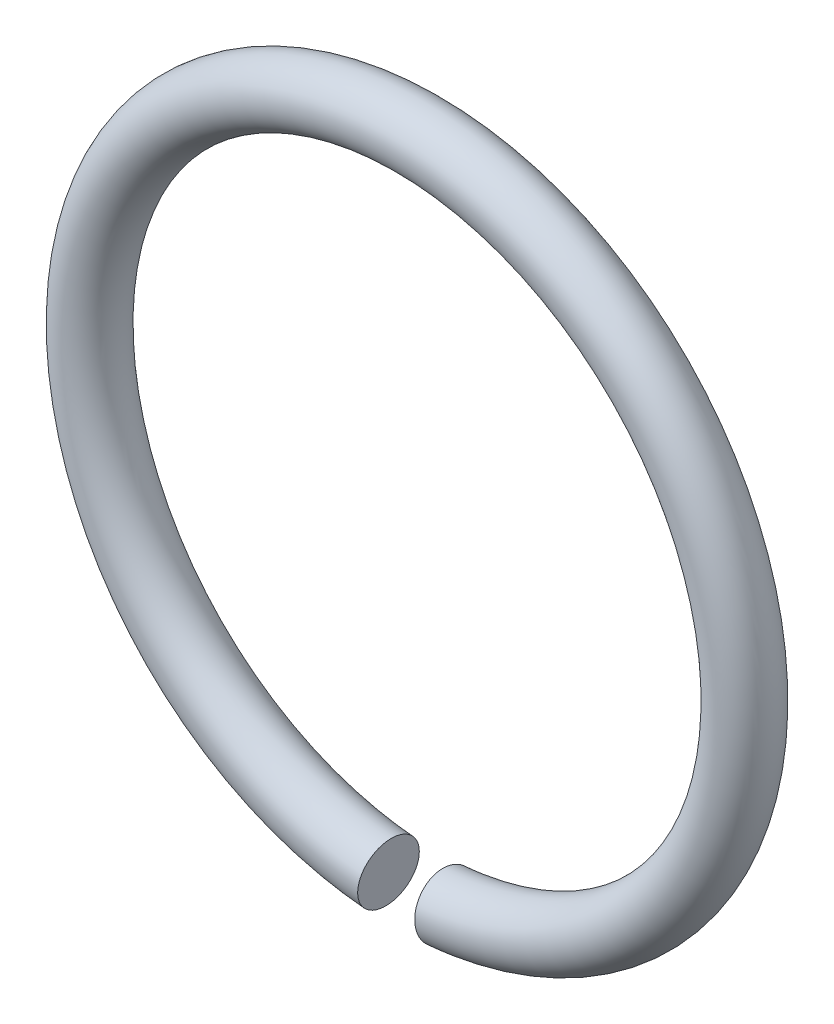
ISO-10303-21;
HEADER;
FILE_DESCRIPTION(('STEP AP214'),'2;1');
FILE_NAME('part.step','',(''),(''),'','','');
FILE_SCHEMA(('AUTOMOTIVE_DESIGN { 1 0 10303 214 1 1 1 1 }'));
ENDSEC;
DATA;
#1=APPLICATION_CONTEXT('core data for automotive mechanical design processes');
#2=APPLICATION_PROTOCOL_DEFINITION('international standard','automotive_design',2000,#1);
#3=PRODUCT_CONTEXT('',#1,'mechanical');
#4=PRODUCT('Part','Part','',(#3));
#5=PRODUCT_RELATED_PRODUCT_CATEGORY('part','',(#4));
#6=PRODUCT_DEFINITION_FORMATION('','',#4);
#7=PRODUCT_DEFINITION_CONTEXT('part definition',#1,'design');
#8=PRODUCT_DEFINITION('design','',#6,#7);
#9=PRODUCT_DEFINITION_SHAPE('','',#8);
#10=(LENGTH_UNIT() NAMED_UNIT(*) SI_UNIT(.MILLI.,.METRE.));
#11=(NAMED_UNIT(*) PLANE_ANGLE_UNIT() SI_UNIT($,.RADIAN.));
#12=(NAMED_UNIT(*) SI_UNIT($,.STERADIAN.) SOLID_ANGLE_UNIT());
#13=UNCERTAINTY_MEASURE_WITH_UNIT(LENGTH_MEASURE(1.E-05),#10,'distance_accuracy_value','');
#14=(GEOMETRIC_REPRESENTATION_CONTEXT(3) GLOBAL_UNCERTAINTY_ASSIGNED_CONTEXT((#13)) GLOBAL_UNIT_ASSIGNED_CONTEXT((#10,
#11,#12)) REPRESENTATION_CONTEXT('',''));
#15=CARTESIAN_POINT('',(0.,0.,0.));
#16=DIRECTION('',(0.,0.,1.));
#17=DIRECTION('',(1.,0.,0.));
#18=AXIS2_PLACEMENT_3D('',#15,#16,#17);
#19=CARTESIAN_POINT('',(0.,0.,-0.4125));
#20=DIRECTION('',(-0.996194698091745,-0.0871557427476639,0.));
#21=DIRECTION('',(0.0871557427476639,-0.996194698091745,0.));
#22=AXIS2_PLACEMENT_3D('',#19,#20,#21);
#23=PLANE('',#22);
#24=CARTESIAN_POINT('',(0.348622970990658,-3.98477879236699,0.375));
#25=CARTESIAN_POINT('',(0.35045775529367,-4.00575047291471,0.374998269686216));
#26=CARTESIAN_POINT('',(0.352294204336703,-4.02674118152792,0.373220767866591));
#27=CARTESIAN_POINT('',(0.355918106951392,-4.06816257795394,0.366149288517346));
#28=CARTESIAN_POINT('',(0.357705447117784,-4.08859196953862,0.360847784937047));
#29=CARTESIAN_POINT('',(0.361174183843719,-4.12823981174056,0.346886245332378));
#30=CARTESIAN_POINT('',(0.362855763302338,-4.14746035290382,0.338232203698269));
#31=CARTESIAN_POINT('',(0.366070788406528,-4.1842082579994,0.317795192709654));
#32=CARTESIAN_POINT('',(0.36760401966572,-4.20173317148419,0.306007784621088));
#33=CARTESIAN_POINT('',(0.370474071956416,-4.23453801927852,0.279663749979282));
#34=CARTESIAN_POINT('',(0.371811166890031,-4.24982108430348,0.265111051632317));
#35=CARTESIAN_POINT('',(0.374255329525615,-4.27775799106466,0.233615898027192));
#36=CARTESIAN_POINT('',(0.375362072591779,-4.29040812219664,0.216670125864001));
#37=CARTESIAN_POINT('',(0.377310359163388,-4.3126771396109,0.180910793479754));
#38=CARTESIAN_POINT('',(0.378152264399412,-4.32230016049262,0.162099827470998));
#39=CARTESIAN_POINT('',(0.379550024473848,-4.33827663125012,0.123097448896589));
#40=CARTESIAN_POINT('',(0.380105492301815,-4.34462565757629,0.102904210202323));
#41=CARTESIAN_POINT('',(0.380912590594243,-4.35385083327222,0.061747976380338));
#42=CARTESIAN_POINT('',(0.381164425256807,-4.35672931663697,0.0407855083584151));
#43=CARTESIAN_POINT('',(0.381357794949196,-4.35893954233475,-0.00132699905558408));
#44=CARTESIAN_POINT('',(0.381299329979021,-4.35827128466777,-0.0224770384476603));
#45=CARTESIAN_POINT('',(0.380873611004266,-4.35340529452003,-0.0643784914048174));
#46=CARTESIAN_POINT('',(0.380506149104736,-4.34920518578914,-0.0851296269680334));
#47=CARTESIAN_POINT('',(0.37947331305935,-4.3373998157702,-0.12560126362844));
#48=CARTESIAN_POINT('',(0.37880834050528,-4.32979914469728,-0.145323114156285));
#49=CARTESIAN_POINT('',(0.377198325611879,-4.31139659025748,-0.183233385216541));
#50=CARTESIAN_POINT('',(0.376252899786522,-4.30059032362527,-0.201419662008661));
#51=CARTESIAN_POINT('',(0.374110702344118,-4.27610489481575,-0.235687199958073));
#52=CARTESIAN_POINT('',(0.372914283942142,-4.26242976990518,-0.251771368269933));
#53=CARTESIAN_POINT('',(0.370301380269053,-4.2325641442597,-0.281429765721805));
#54=CARTESIAN_POINT('',(0.36888458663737,-4.21637011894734,-0.295000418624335));
#55=CARTESIAN_POINT('',(0.36587452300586,-4.18196493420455,-0.319200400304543));
#56=CARTESIAN_POINT('',(0.364281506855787,-4.16375667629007,-0.329833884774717));
#57=CARTESIAN_POINT('',(0.360959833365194,-4.1257897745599,-0.347900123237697));
#58=CARTESIAN_POINT('',(0.359230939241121,-4.10602842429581,-0.355327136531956));
#59=CARTESIAN_POINT('',(0.355691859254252,-4.06557655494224,-0.366728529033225));
#60=CARTESIAN_POINT('',(0.353881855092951,-4.04488811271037,-0.370710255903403));
#61=CARTESIAN_POINT('',(0.350916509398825,-4.01099405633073,-0.374308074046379));
#62=CARTESIAN_POINT('',(0.349770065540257,-3.99789014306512,-0.375001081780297));
#63=CARTESIAN_POINT('',(0.346788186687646,-3.96380711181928,-0.374998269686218));
#64=CARTESIAN_POINT('',(0.344951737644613,-3.94281640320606,-0.373220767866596));
#65=CARTESIAN_POINT('',(0.341327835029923,-3.90139500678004,-0.366149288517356));
#66=CARTESIAN_POINT('',(0.339540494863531,-3.88096561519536,-0.36084778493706));
#67=CARTESIAN_POINT('',(0.336071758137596,-3.84131777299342,-0.346886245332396));
#68=CARTESIAN_POINT('',(0.334390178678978,-3.82209723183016,-0.33823220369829));
#69=CARTESIAN_POINT('',(0.331175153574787,-3.78534932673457,-0.317795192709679));
#70=CARTESIAN_POINT('',(0.329641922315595,-3.76782441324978,-0.306007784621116));
#71=CARTESIAN_POINT('',(0.326771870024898,-3.73501956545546,-0.279663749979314));
#72=CARTESIAN_POINT('',(0.325434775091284,-3.71973650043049,-0.265111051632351));
#73=CARTESIAN_POINT('',(0.322990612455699,-3.6917995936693,-0.23361589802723));
#74=CARTESIAN_POINT('',(0.321883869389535,-3.67914946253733,-0.216670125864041));
#75=CARTESIAN_POINT('',(0.319935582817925,-3.65688044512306,-0.180910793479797));
#76=CARTESIAN_POINT('',(0.319093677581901,-3.64725742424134,-0.162099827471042));
#77=CARTESIAN_POINT('',(0.317695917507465,-3.63128095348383,-0.123097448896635));
#78=CARTESIAN_POINT('',(0.317140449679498,-3.62493192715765,-0.10290421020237));
#79=CARTESIAN_POINT('',(0.316333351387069,-3.61570675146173,-0.0617479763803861));
#80=CARTESIAN_POINT('',(0.316081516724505,-3.61282826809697,-0.0407855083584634));
#81=CARTESIAN_POINT('',(0.315888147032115,-3.61061804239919,0.00132699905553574));
#82=CARTESIAN_POINT('',(0.31594661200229,-3.61128630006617,0.0224770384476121));
#83=CARTESIAN_POINT('',(0.316372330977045,-3.6161522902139,0.06437849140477));
#84=CARTESIAN_POINT('',(0.316739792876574,-3.62035239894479,0.0851296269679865));
#85=CARTESIAN_POINT('',(0.31777262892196,-3.63215776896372,0.125601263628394));
#86=CARTESIAN_POINT('',(0.31843760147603,-3.63975844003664,0.145323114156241));
#87=CARTESIAN_POINT('',(0.32004761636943,-3.65816099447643,0.183233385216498));
#88=CARTESIAN_POINT('',(0.320993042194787,-3.66896726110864,0.20141966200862));
#89=CARTESIAN_POINT('',(0.323135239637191,-3.69345268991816,0.235687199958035));
#90=CARTESIAN_POINT('',(0.324331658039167,-3.70712781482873,0.251771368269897));
#91=CARTESIAN_POINT('',(0.326944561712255,-3.7369934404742,0.281429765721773));
#92=CARTESIAN_POINT('',(0.328361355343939,-3.75318746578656,0.295000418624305));
#93=CARTESIAN_POINT('',(0.331371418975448,-3.78759265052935,0.319200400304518));
#94=CARTESIAN_POINT('',(0.332964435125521,-3.80580090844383,0.329833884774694));
#95=CARTESIAN_POINT('',(0.336286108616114,-3.84376781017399,0.347900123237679));
#96=CARTESIAN_POINT('',(0.338015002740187,-3.86352916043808,0.35532713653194));
#97=CARTESIAN_POINT('',(0.341554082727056,-3.90398102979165,0.366728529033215));
#98=CARTESIAN_POINT('',(0.343364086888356,-3.92466947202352,0.370710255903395));
#99=CARTESIAN_POINT('',(0.346329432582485,-3.95856352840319,0.374308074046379));
#100=CARTESIAN_POINT('',(0.347475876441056,-3.97166744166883,0.375001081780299));
#101=CARTESIAN_POINT('',(0.348622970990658,-3.98477879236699,0.375));
#102=B_SPLINE_CURVE_WITH_KNOTS('',3,(#24,#25,#26,#27,#28,#29,#30,#31,#32,#33,#34,#35,#36,#37,
#38,#39,#40,#41,#42,#43,#44,#45,#46,#47,#48,#49,#50,#51,#52,#53,#54,#55,#56,#57,#58,#59,#60,#61,
#62,#63,#64,#65,#66,#67,#68,#69,#70,#71,#72,#73,#74,#75,#76,#77,#78,#79,#80,#81,#82,#83,#84,#85,
#86,#87,#88,#89,#90,#91,#92,#93,#94,#95,#96,#97,#98,#99,#100,#101),.UNSPECIFIED.,.T.,.F.,(4,2,2,
2,2,2,2,2,2,2,2,2,2,2,2,2,2,2,2,2,2,2,2,2,2,2,2,2,2,2,2,2,2,2,2,2,2,2,4),(0.,0.0631141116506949,
0.126363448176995,0.189500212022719,0.252726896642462,0.315864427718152,0.37909034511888,
0.442229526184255,0.505453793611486,0.568635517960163,0.631817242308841,0.695041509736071,
0.758180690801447,0.821406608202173,0.884544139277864,0.947770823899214,1.01090758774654,
1.07415692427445,1.13727103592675,1.17672954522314,1.23984365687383,1.30309299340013,
1.36622975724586,1.4294564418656,1.49259397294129,1.55581989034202,1.61895907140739,
1.68218333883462,1.7453650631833,1.80854678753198,1.87177105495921,1.93491023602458,
1.99813615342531,2.061273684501,2.12450036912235,2.18763713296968,2.25088646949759,
2.31400058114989,2.35345909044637),.UNSPECIFIED.);
#103=CARTESIAN_POINT('',(0.348622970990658,-3.98477879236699,0.375));
#104=VERTEX_POINT('',#103);
#105=EDGE_CURVE('E19',#104,#104,#102,.T.);
#106=ORIENTED_EDGE('',*,*,#105,.F.);
#107=EDGE_LOOP('',(#106));
#108=FACE_BOUND('',#107,.T.);
#109=ADVANCED_FACE('F13',(#108),#23,.T.);
#110=CARTESIAN_POINT('',(0.,0.,-0.4125));
#111=DIRECTION('',(-0.996194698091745,0.0871557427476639,0.));
#112=DIRECTION('',(-0.0871557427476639,-0.996194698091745,0.));
#113=AXIS2_PLACEMENT_3D('',#110,#111,#112);
#114=PLANE('',#113);
#115=CARTESIAN_POINT('',(-0.348622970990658,-3.98477879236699,-0.375));
#116=CARTESIAN_POINT('',(-0.35045775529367,-4.00575047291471,-0.374998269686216));
#117=CARTESIAN_POINT('',(-0.352294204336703,-4.02674118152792,-0.373220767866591));
#118=CARTESIAN_POINT('',(-0.355918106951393,-4.06816257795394,-0.366149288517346));
#119=CARTESIAN_POINT('',(-0.357705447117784,-4.08859196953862,-0.360847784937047));
#120=CARTESIAN_POINT('',(-0.361174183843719,-4.12823981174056,-0.346886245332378));
#121=CARTESIAN_POINT('',(-0.362855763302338,-4.14746035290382,-0.338232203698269));
#122=CARTESIAN_POINT('',(-0.366070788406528,-4.1842082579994,-0.317795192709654));
#123=CARTESIAN_POINT('',(-0.36760401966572,-4.20173317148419,-0.306007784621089));
#124=CARTESIAN_POINT('',(-0.370474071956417,-4.23453801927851,-0.279663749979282));
#125=CARTESIAN_POINT('',(-0.371811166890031,-4.24982108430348,-0.265111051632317));
#126=CARTESIAN_POINT('',(-0.374255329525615,-4.27775799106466,-0.233615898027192));
#127=CARTESIAN_POINT('',(-0.375362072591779,-4.29040812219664,-0.216670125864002));
#128=CARTESIAN_POINT('',(-0.377310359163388,-4.3126771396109,-0.180910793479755));
#129=CARTESIAN_POINT('',(-0.378152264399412,-4.32230016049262,-0.162099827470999));
#130=CARTESIAN_POINT('',(-0.379550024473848,-4.33827663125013,-0.123097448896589));
#131=CARTESIAN_POINT('',(-0.380105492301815,-4.3446256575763,-0.102904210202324));
#132=CARTESIAN_POINT('',(-0.380912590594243,-4.35385083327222,-0.0617479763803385));
#133=CARTESIAN_POINT('',(-0.381164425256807,-4.35672931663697,-0.0407855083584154));
#134=CARTESIAN_POINT('',(-0.381357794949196,-4.35893954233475,0.00132699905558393));
#135=CARTESIAN_POINT('',(-0.381299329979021,-4.35827128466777,0.0224770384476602));
#136=CARTESIAN_POINT('',(-0.380873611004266,-4.35340529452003,0.0643784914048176));
#137=CARTESIAN_POINT('',(-0.380506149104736,-4.34920518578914,0.0851296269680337));
#138=CARTESIAN_POINT('',(-0.37947331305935,-4.3373998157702,0.12560126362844));
#139=CARTESIAN_POINT('',(-0.37880834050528,-4.32979914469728,0.145323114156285));
#140=CARTESIAN_POINT('',(-0.377198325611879,-4.31139659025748,0.183233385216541));
#141=CARTESIAN_POINT('',(-0.376252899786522,-4.30059032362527,0.201419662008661));
#142=CARTESIAN_POINT('',(-0.374110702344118,-4.27610489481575,0.235687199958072));
#143=CARTESIAN_POINT('',(-0.372914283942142,-4.26242976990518,0.251771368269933));
#144=CARTESIAN_POINT('',(-0.370301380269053,-4.2325641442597,0.281429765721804));
#145=CARTESIAN_POINT('',(-0.36888458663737,-4.21637011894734,0.295000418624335));
#146=CARTESIAN_POINT('',(-0.36587452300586,-4.18196493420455,0.319200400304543));
#147=CARTESIAN_POINT('',(-0.364281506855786,-4.16375667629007,0.329833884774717));
#148=CARTESIAN_POINT('',(-0.360959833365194,-4.1257897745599,0.347900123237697));
#149=CARTESIAN_POINT('',(-0.359230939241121,-4.10602842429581,0.355327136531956));
#150=CARTESIAN_POINT('',(-0.355691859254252,-4.06557655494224,0.366728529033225));
#151=CARTESIAN_POINT('',(-0.353881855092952,-4.04488811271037,0.370710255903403));
#152=CARTESIAN_POINT('',(-0.350916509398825,-4.01099405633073,0.374308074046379));
#153=CARTESIAN_POINT('',(-0.349770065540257,-3.99789014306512,0.375001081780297));
#154=CARTESIAN_POINT('',(-0.346788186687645,-3.96380711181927,0.374998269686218));
#155=CARTESIAN_POINT('',(-0.344951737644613,-3.94281640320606,0.373220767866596));
#156=CARTESIAN_POINT('',(-0.341327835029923,-3.90139500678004,0.366149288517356));
#157=CARTESIAN_POINT('',(-0.339540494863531,-3.88096561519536,0.360847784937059));
#158=CARTESIAN_POINT('',(-0.336071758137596,-3.84131777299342,0.346886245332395));
#159=CARTESIAN_POINT('',(-0.334390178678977,-3.82209723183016,0.338232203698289));
#160=CARTESIAN_POINT('',(-0.331175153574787,-3.78534932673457,0.317795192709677));
#161=CARTESIAN_POINT('',(-0.329641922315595,-3.76782441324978,0.306007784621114));
#162=CARTESIAN_POINT('',(-0.326771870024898,-3.73501956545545,0.279663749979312));
#163=CARTESIAN_POINT('',(-0.325434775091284,-3.71973650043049,0.265111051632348));
#164=CARTESIAN_POINT('',(-0.322990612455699,-3.6917995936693,0.233615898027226));
#165=CARTESIAN_POINT('',(-0.321883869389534,-3.67914946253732,0.216670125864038));
#166=CARTESIAN_POINT('',(-0.319935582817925,-3.65688044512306,0.180910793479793));
#167=CARTESIAN_POINT('',(-0.319093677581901,-3.64725742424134,0.162099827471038));
#168=CARTESIAN_POINT('',(-0.317695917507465,-3.63128095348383,0.123097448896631));
#169=CARTESIAN_POINT('',(-0.317140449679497,-3.62493192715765,0.102904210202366));
#170=CARTESIAN_POINT('',(-0.316333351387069,-3.61570675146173,0.0617479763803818));
#171=CARTESIAN_POINT('',(-0.316081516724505,-3.61282826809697,0.0407855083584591));
#172=CARTESIAN_POINT('',(-0.315888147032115,-3.61061804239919,-0.00132699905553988));
#173=CARTESIAN_POINT('',(-0.31594661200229,-3.61128630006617,-0.0224770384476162));
#174=CARTESIAN_POINT('',(-0.316372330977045,-3.6161522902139,-0.0643784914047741));
#175=CARTESIAN_POINT('',(-0.316739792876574,-3.62035239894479,-0.0851296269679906));
#176=CARTESIAN_POINT('',(-0.31777262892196,-3.63215776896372,-0.125601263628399));
#177=CARTESIAN_POINT('',(-0.31843760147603,-3.63975844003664,-0.145323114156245));
#178=CARTESIAN_POINT('',(-0.32004761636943,-3.65816099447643,-0.183233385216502));
#179=CARTESIAN_POINT('',(-0.320993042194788,-3.66896726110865,-0.201419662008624));
#180=CARTESIAN_POINT('',(-0.323135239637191,-3.69345268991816,-0.235687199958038));
#181=CARTESIAN_POINT('',(-0.324331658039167,-3.70712781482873,-0.2517713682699));
#182=CARTESIAN_POINT('',(-0.326944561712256,-3.73699344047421,-0.281429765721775));
#183=CARTESIAN_POINT('',(-0.328361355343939,-3.75318746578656,-0.295000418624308));
#184=CARTESIAN_POINT('',(-0.331371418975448,-3.78759265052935,-0.31920040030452));
#185=CARTESIAN_POINT('',(-0.332964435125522,-3.80580090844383,-0.329833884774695));
#186=CARTESIAN_POINT('',(-0.336286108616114,-3.843767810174,-0.34790012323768));
#187=CARTESIAN_POINT('',(-0.338015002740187,-3.86352916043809,-0.355327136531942));
#188=CARTESIAN_POINT('',(-0.341554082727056,-3.90398102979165,-0.366728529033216));
#189=CARTESIAN_POINT('',(-0.343364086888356,-3.92466947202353,-0.370710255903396));
#190=CARTESIAN_POINT('',(-0.346329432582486,-3.95856352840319,-0.374308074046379));
#191=CARTESIAN_POINT('',(-0.347475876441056,-3.97166744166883,-0.375001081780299));
#192=CARTESIAN_POINT('',(-0.348622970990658,-3.98477879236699,-0.375));
#193=B_SPLINE_CURVE_WITH_KNOTS('',3,(#115,#116,#117,#118,#119,#120,#121,#122,#123,#124,#125,
#126,#127,#128,#129,#130,#131,#132,#133,#134,#135,#136,#137,#138,#139,#140,#141,#142,#143,#144,
#145,#146,#147,#148,#149,#150,#151,#152,#153,#154,#155,#156,#157,#158,#159,#160,#161,#162,#163,
#164,#165,#166,#167,#168,#169,#170,#171,#172,#173,#174,#175,#176,#177,#178,#179,#180,#181,#182,
#183,#184,#185,#186,#187,#188,#189,#190,#191,#192),.UNSPECIFIED.,.T.,.F.,(4,2,2,2,2,2,2,2,2,2,2,
2,2,2,2,2,2,2,2,2,2,2,2,2,2,2,2,2,2,2,2,2,2,2,2,2,2,2,4),(0.,0.0631141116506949,
0.126363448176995,0.189500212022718,0.252726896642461,0.315864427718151,0.379090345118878,
0.442229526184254,0.505453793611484,0.568635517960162,0.63181724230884,0.69504150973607,
0.758180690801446,0.821406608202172,0.884544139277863,0.947770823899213,1.01090758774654,
1.07415692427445,1.13727103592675,1.17672954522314,1.23984365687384,1.30309299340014,
1.36622975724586,1.4294564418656,1.49259397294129,1.55581989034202,1.61895907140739,
1.68218333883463,1.7453650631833,1.80854678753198,1.87177105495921,1.93491023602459,
1.99813615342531,2.061273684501,2.12450036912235,2.18763713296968,2.25088646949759,
2.31400058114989,2.35345909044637),.UNSPECIFIED.);
#194=CARTESIAN_POINT('',(-0.348622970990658,-3.98477879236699,-0.375));
#195=VERTEX_POINT('',#194);
#196=EDGE_CURVE('E9',#195,#195,#193,.T.);
#197=ORIENTED_EDGE('',*,*,#196,.F.);
#198=EDGE_LOOP('',(#197));
#199=FACE_BOUND('',#198,.T.);
#200=ADVANCED_FACE('F32',(#199),#114,.F.);
#201=CARTESIAN_POINT('',(0.,0.,0.));
#202=DIRECTION('',(0.,0.,1.));
#203=DIRECTION('',(-0.0871557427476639,-0.996194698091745,0.));
#204=AXIS2_PLACEMENT_3D('',#201,#202,#203);
#205=TOROIDAL_SURFACE('',#204,4.,0.375);
#206=ORIENTED_EDGE('',*,*,#105,.T.);
#207=EDGE_LOOP('',(#206));
#208=FACE_BOUND('',#207,.T.);
#209=ORIENTED_EDGE('',*,*,#196,.T.);
#210=EDGE_LOOP('',(#209));
#211=FACE_BOUND('',#210,.T.);
#212=ADVANCED_FACE('F15',(#208,#211),#205,.T.);
#213=CLOSED_SHELL('',(#109,#200,#212));
#214=MANIFOLD_SOLID_BREP('B1',#213);
#215=ADVANCED_BREP_SHAPE_REPRESENTATION('',(#18,#214),#14);
#216=SHAPE_DEFINITION_REPRESENTATION(#9,#215);
ENDSEC;
END-ISO-10303-21;
